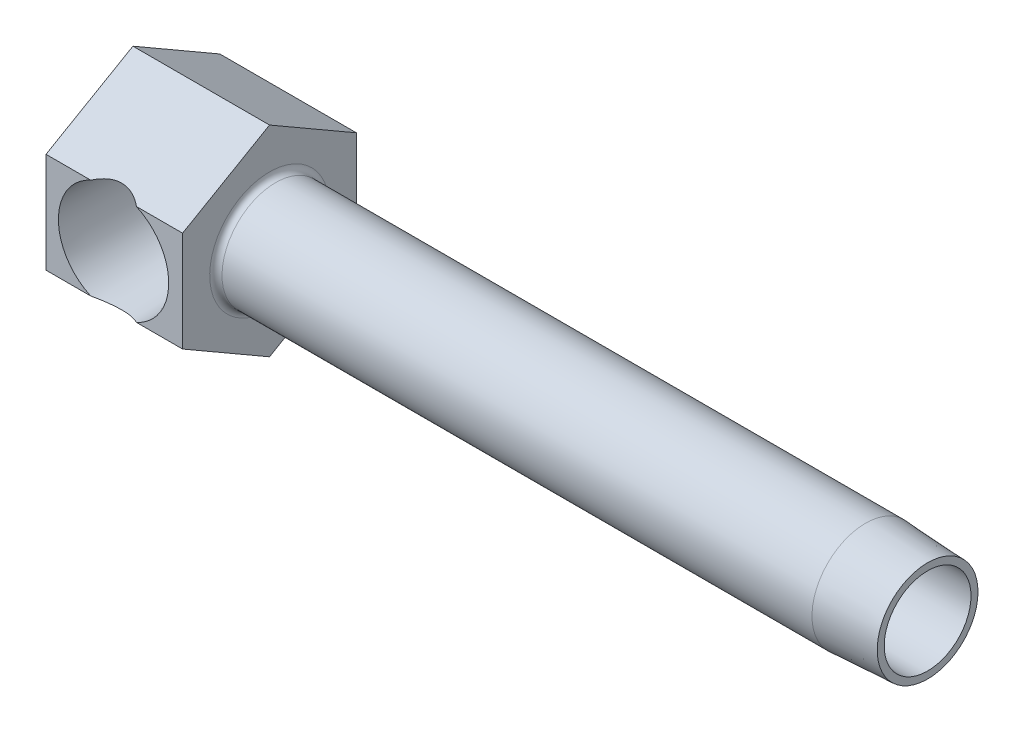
ISO-10303-21;
HEADER;
FILE_DESCRIPTION(('STEP AP214'),'2;1');
FILE_NAME('part.step','',(''),(''),'','','');
FILE_SCHEMA(('AUTOMOTIVE_DESIGN { 1 0 10303 214 1 1 1 1 }'));
ENDSEC;
DATA;
#1=APPLICATION_CONTEXT('core data for automotive mechanical design processes');
#2=APPLICATION_PROTOCOL_DEFINITION('international standard','automotive_design',2000,#1);
#3=PRODUCT_CONTEXT('',#1,'mechanical');
#4=PRODUCT('Part','Part','',(#3));
#5=PRODUCT_RELATED_PRODUCT_CATEGORY('part','',(#4));
#6=PRODUCT_DEFINITION_FORMATION('','',#4);
#7=PRODUCT_DEFINITION_CONTEXT('part definition',#1,'design');
#8=PRODUCT_DEFINITION('design','',#6,#7);
#9=PRODUCT_DEFINITION_SHAPE('','',#8);
#10=(LENGTH_UNIT() NAMED_UNIT(*) SI_UNIT(.MILLI.,.METRE.));
#11=(NAMED_UNIT(*) PLANE_ANGLE_UNIT() SI_UNIT($,.RADIAN.));
#12=(NAMED_UNIT(*) SI_UNIT($,.STERADIAN.) SOLID_ANGLE_UNIT());
#13=UNCERTAINTY_MEASURE_WITH_UNIT(LENGTH_MEASURE(1.E-05),#10,'distance_accuracy_value','');
#14=(GEOMETRIC_REPRESENTATION_CONTEXT(3) GLOBAL_UNCERTAINTY_ASSIGNED_CONTEXT((#13)) GLOBAL_UNIT_ASSIGNED_CONTEXT((#10,
#11,#12)) REPRESENTATION_CONTEXT('',''));
#15=CARTESIAN_POINT('',(0.,0.,0.));
#16=DIRECTION('',(0.,0.,1.));
#17=DIRECTION('',(1.,0.,0.));
#18=AXIS2_PLACEMENT_3D('',#15,#16,#17);
#19=CARTESIAN_POINT('',(63.5,0.,11.1125));
#20=DIRECTION('',(-1.,0.,0.));
#21=DIRECTION('',(0.,0.,1.));
#22=AXIS2_PLACEMENT_3D('',#19,#20,#21);
#23=CYLINDRICAL_SURFACE('',#22,6.858);
#24=CARTESIAN_POINT('',(18.2499,0.,11.1125));
#25=DIRECTION('',(-1.,0.,0.));
#26=DIRECTION('',(0.,-1.,0.));
#27=AXIS2_PLACEMENT_3D('',#24,#25,#26);
#28=CIRCLE('',#27,6.858);
#29=CARTESIAN_POINT('',(18.2499,-6.858,11.1125));
#30=VERTEX_POINT('',#29);
#31=EDGE_CURVE('E174',#30,#30,#28,.F.);
#32=ORIENTED_EDGE('',*,*,#31,.T.);
#33=EDGE_LOOP('',(#32));
#34=FACE_BOUND('',#33,.T.);
#35=CARTESIAN_POINT('',(93.6752,0.,11.1125));
#36=DIRECTION('',(1.,0.,0.));
#37=DIRECTION('',(0.,0.,-1.));
#38=AXIS2_PLACEMENT_3D('',#35,#36,#37);
#39=CIRCLE('',#38,6.858);
#40=CARTESIAN_POINT('',(93.6752,0.,4.2545));
#41=VERTEX_POINT('',#40);
#42=EDGE_CURVE('E218',#41,#41,#39,.T.);
#43=ORIENTED_EDGE('',*,*,#42,.F.);
#44=EDGE_LOOP('',(#43));
#45=FACE_BOUND('',#44,.T.);
#46=ADVANCED_FACE('F15',(#34,#45),#23,.T.);
#47=CARTESIAN_POINT('',(17.4625,6.4158048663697,22.225));
#48=DIRECTION('',(0.,0.,-1.));
#49=DIRECTION('',(0.,1.,0.));
#50=AXIS2_PLACEMENT_3D('',#47,#48,#49);
#51=PLANE('',#50);
#52=CARTESIAN_POINT('',(8.636,0.,22.225));
#53=DIRECTION('',(0.,0.,1.));
#54=DIRECTION('',(1.,0.,0.));
#55=AXIS2_PLACEMENT_3D('',#52,#53,#54);
#56=CIRCLE('',#55,7.05231);
#57=CARTESIAN_POINT('',(5.70811266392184,6.4158048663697,22.225));
#58=VERTEX_POINT('',#57);
#59=CARTESIAN_POINT('',(5.70811266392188,-6.41580486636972,22.225));
#60=VERTEX_POINT('',#59);
#61=EDGE_CURVE('E229',#58,#60,#56,.T.);
#62=ORIENTED_EDGE('',*,*,#61,.F.);
#63=DIRECTION('',(-1.,0.,0.));
#64=VECTOR('',#63,1.);
#65=CARTESIAN_POINT('',(17.4625,6.4158048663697,22.225));
#66=LINE('',#65,#64);
#67=CARTESIAN_POINT('',(0.,6.4158048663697,22.225));
#68=VERTEX_POINT('',#67);
#69=EDGE_CURVE('E158',#58,#68,#66,.T.);
#70=ORIENTED_EDGE('',*,*,#69,.T.);
#71=DIRECTION('',(0.,-1.,0.));
#72=VECTOR('',#71,1.);
#73=CARTESIAN_POINT('',(0.,6.4158048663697,22.225));
#74=LINE('',#73,#72);
#75=CARTESIAN_POINT('',(0.,-6.41580486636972,22.225));
#76=VERTEX_POINT('',#75);
#77=EDGE_CURVE('E128',#68,#76,#74,.T.);
#78=ORIENTED_EDGE('',*,*,#77,.T.);
#79=DIRECTION('',(-1.,0.,0.));
#80=VECTOR('',#79,1.);
#81=CARTESIAN_POINT('',(17.4625,-6.41580486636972,22.225));
#82=LINE('',#81,#80);
#83=EDGE_CURVE('E154',#60,#76,#82,.T.);
#84=ORIENTED_EDGE('',*,*,#83,.F.);
#85=EDGE_LOOP('',(#62,#70,#78,#84));
#86=FACE_BOUND('',#85,.T.);
#87=ADVANCED_FACE('F205',(#86),#51,.F.);
#88=CARTESIAN_POINT('',(11.5638873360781,-6.41580486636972,22.225));
#89=VERTEX_POINT('',#88);
#90=CARTESIAN_POINT('',(11.5638873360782,6.4158048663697,22.225));
#91=VERTEX_POINT('',#90);
#92=EDGE_CURVE('E228',#89,#91,#56,.T.);
#93=ORIENTED_EDGE('',*,*,#92,.F.);
#94=CARTESIAN_POINT('',(17.4625,-6.41580486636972,22.225));
#95=VERTEX_POINT('',#94);
#96=EDGE_CURVE('E155',#95,#89,#82,.T.);
#97=ORIENTED_EDGE('',*,*,#96,.F.);
#98=DIRECTION('',(0.,-1.,0.));
#99=VECTOR('',#98,1.);
#100=CARTESIAN_POINT('',(17.4625,6.4158048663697,22.225));
#101=LINE('',#100,#99);
#102=CARTESIAN_POINT('',(17.4625,6.4158048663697,22.225));
#103=VERTEX_POINT('',#102);
#104=EDGE_CURVE('E145',#103,#95,#101,.T.);
#105=ORIENTED_EDGE('',*,*,#104,.F.);
#106=EDGE_CURVE('E159',#103,#91,#66,.T.);
#107=ORIENTED_EDGE('',*,*,#106,.T.);
#108=EDGE_LOOP('',(#93,#97,#105,#107));
#109=FACE_BOUND('',#108,.T.);
#110=ADVANCED_FACE('F211',(#109),#51,.F.);
#111=CARTESIAN_POINT('',(17.4625,12.8316097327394,11.1125));
#112=DIRECTION('',(0.,-0.866025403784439,-0.5));
#113=DIRECTION('',(0.,0.5,-0.866025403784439));
#114=AXIS2_PLACEMENT_3D('',#111,#112,#113);
#115=PLANE('',#114);
#116=ORIENTED_EDGE('',*,*,#69,.F.);
#117=CARTESIAN_POINT('',(8.636,-0.384020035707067,34.002642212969));
#118=DIRECTION('',(0.,-0.866025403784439,-0.5));
#119=DIRECTION('',(0.,-0.5,0.866025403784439));
#120=AXIS2_PLACEMENT_3D('',#117,#118,#119);
#121=ELLIPSE('',#120,14.8098967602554,7.39498405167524);
#122=EDGE_CURVE('E109',#58,#91,#121,.T.);
#123=ORIENTED_EDGE('',*,*,#122,.T.);
#124=ORIENTED_EDGE('',*,*,#106,.F.);
#125=DIRECTION('',(0.,-0.5,0.866025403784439));
#126=VECTOR('',#125,1.);
#127=CARTESIAN_POINT('',(17.4625,12.8316097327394,11.1125));
#128=LINE('',#127,#126);
#129=CARTESIAN_POINT('',(17.4625,12.8316097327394,11.1125));
#130=VERTEX_POINT('',#129);
#131=EDGE_CURVE('E143',#130,#103,#128,.T.);
#132=ORIENTED_EDGE('',*,*,#131,.F.);
#133=DIRECTION('',(-1.,0.,0.));
#134=VECTOR('',#133,1.);
#135=CARTESIAN_POINT('',(17.4625,12.8316097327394,11.1125));
#136=LINE('',#135,#134);
#137=CARTESIAN_POINT('',(0.,12.8316097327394,11.1125));
#138=VERTEX_POINT('',#137);
#139=EDGE_CURVE('E162',#130,#138,#136,.T.);
#140=ORIENTED_EDGE('',*,*,#139,.T.);
#141=DIRECTION('',(0.,-0.5,0.866025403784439));
#142=VECTOR('',#141,1.);
#143=CARTESIAN_POINT('',(0.,12.8316097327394,11.1125));
#144=LINE('',#143,#142);
#145=EDGE_CURVE('E124',#138,#68,#144,.T.);
#146=ORIENTED_EDGE('',*,*,#145,.T.);
#147=EDGE_LOOP('',(#116,#123,#124,#132,#140,#146));
#148=FACE_BOUND('',#147,.T.);
#149=ADVANCED_FACE('F257',(#148),#115,.F.);
#150=CARTESIAN_POINT('',(17.4625,-6.41580486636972,22.225));
#151=DIRECTION('',(0.,0.866025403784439,-0.5));
#152=DIRECTION('',(0.,0.5,0.866025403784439));
#153=AXIS2_PLACEMENT_3D('',#150,#151,#152);
#154=PLANE('',#153);
#155=ORIENTED_EDGE('',*,*,#96,.T.);
#156=CARTESIAN_POINT('',(8.636,0.384020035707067,34.0026422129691));
#157=DIRECTION('',(0.,0.866025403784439,-0.5));
#158=DIRECTION('',(0.,0.5,0.866025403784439));
#159=AXIS2_PLACEMENT_3D('',#156,#157,#158);
#160=ELLIPSE('',#159,14.8098967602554,7.39498405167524);
#161=EDGE_CURVE('E34',#89,#60,#160,.T.);
#162=ORIENTED_EDGE('',*,*,#161,.T.);
#163=ORIENTED_EDGE('',*,*,#83,.T.);
#164=DIRECTION('',(0.,-0.5,-0.866025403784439));
#165=VECTOR('',#164,1.);
#166=CARTESIAN_POINT('',(0.,-6.41580486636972,22.225));
#167=LINE('',#166,#165);
#168=CARTESIAN_POINT('',(0.,-12.8316097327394,11.1125));
#169=VERTEX_POINT('',#168);
#170=EDGE_CURVE('E132',#76,#169,#167,.T.);
#171=ORIENTED_EDGE('',*,*,#170,.T.);
#172=DIRECTION('',(-1.,0.,0.));
#173=VECTOR('',#172,1.);
#174=CARTESIAN_POINT('',(17.4625,-12.8316097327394,11.1125));
#175=LINE('',#174,#173);
#176=CARTESIAN_POINT('',(17.4625,-12.8316097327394,11.1125));
#177=VERTEX_POINT('',#176);
#178=EDGE_CURVE('E149',#177,#169,#175,.T.);
#179=ORIENTED_EDGE('',*,*,#178,.F.);
#180=DIRECTION('',(0.,-0.5,-0.866025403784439));
#181=VECTOR('',#180,1.);
#182=CARTESIAN_POINT('',(17.4625,-6.41580486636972,22.225));
#183=LINE('',#182,#181);
#184=EDGE_CURVE('E147',#95,#177,#183,.T.);
#185=ORIENTED_EDGE('',*,*,#184,.F.);
#186=EDGE_LOOP('',(#155,#162,#163,#171,#179,#185));
#187=FACE_BOUND('',#186,.T.);
#188=ADVANCED_FACE('F235',(#187),#154,.F.);
#189=CARTESIAN_POINT('',(17.4625,-12.8316097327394,11.1125));
#190=DIRECTION('',(0.,0.866025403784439,0.5));
#191=DIRECTION('',(0.,-0.5,0.866025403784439));
#192=AXIS2_PLACEMENT_3D('',#189,#190,#191);
#193=PLANE('',#192);
#194=DIRECTION('',(0.,0.5,-0.866025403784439));
#195=VECTOR('',#194,1.);
#196=CARTESIAN_POINT('',(0.,-12.8316097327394,11.1125));
#197=LINE('',#196,#195);
#198=CARTESIAN_POINT('',(0.,-6.41580486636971,0.));
#199=VERTEX_POINT('',#198);
#200=EDGE_CURVE('E117',#169,#199,#197,.T.);
#201=ORIENTED_EDGE('',*,*,#200,.T.);
#202=DIRECTION('',(-1.,0.,0.));
#203=VECTOR('',#202,1.);
#204=CARTESIAN_POINT('',(17.4625,-6.41580486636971,0.));
#205=LINE('',#204,#203);
#206=CARTESIAN_POINT('',(17.4625,-6.41580486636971,0.));
#207=VERTEX_POINT('',#206);
#208=EDGE_CURVE('E168',#207,#199,#205,.T.);
#209=ORIENTED_EDGE('',*,*,#208,.F.);
#210=DIRECTION('',(0.,0.5,-0.866025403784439));
#211=VECTOR('',#210,1.);
#212=CARTESIAN_POINT('',(17.4625,-12.8316097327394,11.1125));
#213=LINE('',#212,#211);
#214=EDGE_CURVE('E135',#177,#207,#213,.T.);
#215=ORIENTED_EDGE('',*,*,#214,.F.);
#216=ORIENTED_EDGE('',*,*,#178,.T.);
#217=EDGE_LOOP('',(#201,#209,#215,#216));
#218=FACE_BOUND('',#217,.T.);
#219=ADVANCED_FACE('F247',(#218),#193,.F.);
#220=CARTESIAN_POINT('',(17.4625,-6.41580486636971,0.));
#221=DIRECTION('',(0.,0.,1.));
#222=DIRECTION('',(1.,0.,0.));
#223=AXIS2_PLACEMENT_3D('',#220,#221,#222);
#224=PLANE('',#223);
#225=DIRECTION('',(0.,1.,0.));
#226=VECTOR('',#225,1.);
#227=CARTESIAN_POINT('',(0.,-6.41580486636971,0.));
#228=LINE('',#227,#226);
#229=CARTESIAN_POINT('',(0.,6.41580486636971,0.));
#230=VERTEX_POINT('',#229);
#231=EDGE_CURVE('E118',#199,#230,#228,.T.);
#232=ORIENTED_EDGE('',*,*,#231,.T.);
#233=DIRECTION('',(-1.,0.,0.));
#234=VECTOR('',#233,1.);
#235=CARTESIAN_POINT('',(17.4625,6.41580486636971,0.));
#236=LINE('',#235,#234);
#237=CARTESIAN_POINT('',(17.4625,6.41580486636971,0.));
#238=VERTEX_POINT('',#237);
#239=EDGE_CURVE('E165',#238,#230,#236,.T.);
#240=ORIENTED_EDGE('',*,*,#239,.F.);
#241=DIRECTION('',(0.,1.,0.));
#242=VECTOR('',#241,1.);
#243=CARTESIAN_POINT('',(17.4625,-6.41580486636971,0.));
#244=LINE('',#243,#242);
#245=EDGE_CURVE('E139',#207,#238,#244,.T.);
#246=ORIENTED_EDGE('',*,*,#245,.F.);
#247=ORIENTED_EDGE('',*,*,#208,.T.);
#248=EDGE_LOOP('',(#232,#240,#246,#247));
#249=FACE_BOUND('',#248,.T.);
#250=ADVANCED_FACE('F264',(#249),#224,.F.);
#251=CARTESIAN_POINT('',(17.4625,6.4158048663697,0.));
#252=DIRECTION('',(0.,-0.866025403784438,0.5));
#253=DIRECTION('',(0.,-0.5,-0.866025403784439));
#254=AXIS2_PLACEMENT_3D('',#251,#252,#253);
#255=PLANE('',#254);
#256=DIRECTION('',(0.,0.5,0.866025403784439));
#257=VECTOR('',#256,1.);
#258=CARTESIAN_POINT('',(0.,6.4158048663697,0.));
#259=LINE('',#258,#257);
#260=EDGE_CURVE('E121',#230,#138,#259,.T.);
#261=ORIENTED_EDGE('',*,*,#260,.T.);
#262=ORIENTED_EDGE('',*,*,#139,.F.);
#263=DIRECTION('',(0.,0.5,0.866025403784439));
#264=VECTOR('',#263,1.);
#265=CARTESIAN_POINT('',(17.4625,6.4158048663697,0.));
#266=LINE('',#265,#264);
#267=EDGE_CURVE('E141',#238,#130,#266,.T.);
#268=ORIENTED_EDGE('',*,*,#267,.F.);
#269=ORIENTED_EDGE('',*,*,#239,.T.);
#270=EDGE_LOOP('',(#261,#262,#268,#269));
#271=FACE_BOUND('',#270,.T.);
#272=ADVANCED_FACE('F261',(#271),#255,.F.);
#273=CARTESIAN_POINT('',(17.4625,-19.2474145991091,22.225));
#274=DIRECTION('',(-1.,0.,0.));
#275=DIRECTION('',(0.,-1.,0.));
#276=AXIS2_PLACEMENT_3D('',#273,#274,#275);
#277=PLANE('',#276);
#278=CARTESIAN_POINT('',(17.4625,0.,11.1125));
#279=DIRECTION('',(-1.,0.,0.));
#280=DIRECTION('',(0.,-1.,0.));
#281=AXIS2_PLACEMENT_3D('',#278,#279,#280);
#282=CIRCLE('',#281,7.6454);
#283=CARTESIAN_POINT('',(17.4625,-7.6454,11.1125));
#284=VERTEX_POINT('',#283);
#285=EDGE_CURVE('E171',#284,#284,#282,.T.);
#286=ORIENTED_EDGE('',*,*,#285,.T.);
#287=EDGE_LOOP('',(#286));
#288=FACE_BOUND('',#287,.T.);
#289=ORIENTED_EDGE('',*,*,#214,.T.);
#290=ORIENTED_EDGE('',*,*,#245,.T.);
#291=ORIENTED_EDGE('',*,*,#267,.T.);
#292=ORIENTED_EDGE('',*,*,#131,.T.);
#293=ORIENTED_EDGE('',*,*,#104,.T.);
#294=ORIENTED_EDGE('',*,*,#184,.T.);
#295=EDGE_LOOP('',(#289,#290,#291,#292,#293,#294));
#296=FACE_BOUND('',#295,.T.);
#297=ADVANCED_FACE('F250',(#288,#296),#277,.F.);
#298=CARTESIAN_POINT('',(0.,-19.2474145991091,22.225));
#299=DIRECTION('',(-1.,0.,0.));
#300=DIRECTION('',(0.,-1.,0.));
#301=AXIS2_PLACEMENT_3D('',#298,#299,#300);
#302=PLANE('',#301);
#303=ORIENTED_EDGE('',*,*,#200,.F.);
#304=ORIENTED_EDGE('',*,*,#170,.F.);
#305=ORIENTED_EDGE('',*,*,#77,.F.);
#306=ORIENTED_EDGE('',*,*,#145,.F.);
#307=ORIENTED_EDGE('',*,*,#260,.F.);
#308=ORIENTED_EDGE('',*,*,#231,.F.);
#309=EDGE_LOOP('',(#303,#304,#305,#306,#307,#308));
#310=FACE_BOUND('',#309,.T.);
#311=ADVANCED_FACE('F243',(#310),#302,.T.);
#312=CARTESIAN_POINT('',(18.2499,0.,11.1125));
#313=DIRECTION('',(-1.,0.,0.));
#314=DIRECTION('',(0.,-1.,0.));
#315=AXIS2_PLACEMENT_3D('',#312,#313,#314);
#316=TOROIDAL_SURFACE('',#315,7.6454,0.7874);
#317=ORIENTED_EDGE('',*,*,#31,.F.);
#318=EDGE_LOOP('',(#317));
#319=FACE_BOUND('',#318,.T.);
#320=ORIENTED_EDGE('',*,*,#285,.F.);
#321=EDGE_LOOP('',(#320));
#322=FACE_BOUND('',#321,.T.);
#323=ADVANCED_FACE('F282',(#319,#322),#316,.F.);
#324=CARTESIAN_POINT('',(63.5,0.,11.1125));
#325=DIRECTION('',(1.,0.,0.));
#326=DIRECTION('',(0.,0.,-1.));
#327=AXIS2_PLACEMENT_3D('',#324,#325,#326);
#328=CYLINDRICAL_SURFACE('',#327,5.5499);
#329=DIRECTION('',(1.,0.,0.));
#330=VECTOR('',#329,1.);
#331=CARTESIAN_POINT('',(63.5,1.29165930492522,5.715));
#332=LINE('',#331,#330);
#333=CARTESIAN_POINT('',(15.0655177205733,1.29165930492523,5.715));
#334=VERTEX_POINT('',#333);
#335=CARTESIAN_POINT('',(14.0465577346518,1.29165930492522,5.715));
#336=VERTEX_POINT('',#335);
#337=EDGE_CURVE('E27',#334,#336,#332,.F.);
#338=ORIENTED_EDGE('',*,*,#337,.T.);
#339=CARTESIAN_POINT('',(14.0465577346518,1.29165930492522,5.715));
#340=CARTESIAN_POINT('',(14.0725617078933,1.1828202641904,5.68893317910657));
#341=CARTESIAN_POINT('',(14.0954190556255,1.0724477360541,5.66602138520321));
#342=CARTESIAN_POINT('',(14.1345363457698,0.849345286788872,5.62681178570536));
#343=CARTESIAN_POINT('',(14.1507939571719,0.736614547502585,5.61051631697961));
#344=CARTESIAN_POINT('',(14.1760383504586,0.512691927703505,5.58521342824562));
#345=CARTESIAN_POINT('',(14.1852120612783,0.401542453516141,5.57601863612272));
#346=CARTESIAN_POINT('',(14.1968530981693,0.17856718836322,5.56435088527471));
#347=CARTESIAN_POINT('',(14.1993222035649,0.0667415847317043,5.56187614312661));
#348=CARTESIAN_POINT('',(14.1975723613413,-0.14949882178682,5.56362999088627));
#349=CARTESIAN_POINT('',(14.193779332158,-0.253921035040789,5.56743168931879));
#350=CARTESIAN_POINT('',(14.1803598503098,-0.462026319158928,5.58088200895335));
#351=CARTESIAN_POINT('',(14.1707325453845,-0.565709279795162,5.59053148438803));
#352=CARTESIAN_POINT('',(14.1454600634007,-0.774399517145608,5.61586264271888));
#353=CARTESIAN_POINT('',(14.12966315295,-0.87936981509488,5.63169642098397));
#354=CARTESIAN_POINT('',(14.092340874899,-1.08722287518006,5.6691068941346));
#355=CARTESIAN_POINT('',(14.0708169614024,-1.1901061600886,5.69068213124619));
#356=CARTESIAN_POINT('',(14.0465577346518,-1.29165930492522,5.715));
#357=B_SPLINE_CURVE_WITH_KNOTS('',3,(#339,#340,#341,#342,#343,#344,#345,#346,#347,#348,#349,
#350,#351,#352,#353,#354,#355,#356),.UNSPECIFIED.,.F.,.F.,(4,2,2,2,2,2,2,2,4),(0.,
0.344637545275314,0.689396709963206,1.02471413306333,1.35994255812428,1.67329546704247,
1.98669416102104,2.30834220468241,2.62990865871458),.UNSPECIFIED.);
#358=CARTESIAN_POINT('',(14.0465577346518,-1.29165930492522,5.715));
#359=VERTEX_POINT('',#358);
#360=EDGE_CURVE('E10',#336,#359,#357,.T.);
#361=ORIENTED_EDGE('',*,*,#360,.T.);
#362=DIRECTION('',(1.,0.,0.));
#363=VECTOR('',#362,1.);
#364=CARTESIAN_POINT('',(63.5,-1.29165930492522,5.715));
#365=LINE('',#364,#363);
#366=CARTESIAN_POINT('',(15.0655177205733,-1.29165930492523,5.715));
#367=VERTEX_POINT('',#366);
#368=EDGE_CURVE('E184',#359,#367,#365,.T.);
#369=ORIENTED_EDGE('',*,*,#368,.T.);
#370=CARTESIAN_POINT('',(15.0656795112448,-1.29082327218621,5.71480000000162));
#371=CARTESIAN_POINT('',(15.0372536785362,-1.43791824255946,5.7499521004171));
#372=CARTESIAN_POINT('',(15.0041876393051,-1.58262926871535,5.79093746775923));
#373=CARTESIAN_POINT('',(14.9298152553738,-1.86616189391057,5.88364074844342));
#374=CARTESIAN_POINT('',(14.8885204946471,-2.00499144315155,5.93534357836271));
#375=CARTESIAN_POINT('',(14.7990709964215,-2.27477346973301,6.0481148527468));
#376=CARTESIAN_POINT('',(14.7509848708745,-2.40578805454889,6.10909004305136));
#377=CARTESIAN_POINT('',(14.6486806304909,-2.66083130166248,6.2399326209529));
#378=CARTESIAN_POINT('',(14.5944604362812,-2.78485757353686,6.30980302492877));
#379=CARTESIAN_POINT('',(14.4812536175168,-3.02482355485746,6.4572285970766));
#380=CARTESIAN_POINT('',(14.4222960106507,-3.1408054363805,6.53473755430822));
#381=CARTESIAN_POINT('',(14.3003856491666,-3.365215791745,6.6970845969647));
#382=CARTESIAN_POINT('',(14.2374332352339,-3.47364490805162,6.78192205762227));
#383=CARTESIAN_POINT('',(14.0435453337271,-3.78827180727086,7.04729631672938));
#384=CARTESIAN_POINT('',(13.9079456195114,-3.9830565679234,7.23822682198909));
#385=CARTESIAN_POINT('',(13.689310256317,-4.26816238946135,7.56146618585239));
#386=CARTESIAN_POINT('',(13.6074310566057,-4.3686517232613,7.68585924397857));
#387=CARTESIAN_POINT('',(13.4442899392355,-4.55879004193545,7.94320688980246));
#388=CARTESIAN_POINT('',(13.3630282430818,-4.6484352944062,8.07616440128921));
#389=CARTESIAN_POINT('',(13.2036424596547,-4.81645966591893,8.35044586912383));
#390=CARTESIAN_POINT('',(13.1255135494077,-4.89485662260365,8.49175606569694));
#391=CARTESIAN_POINT('',(12.9752684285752,-5.04004510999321,8.78316437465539));
#392=CARTESIAN_POINT('',(12.9031480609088,-5.10684469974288,8.93325628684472));
#393=CARTESIAN_POINT('',(12.757824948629,-5.23785122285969,9.26762207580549));
#394=CARTESIAN_POINT('',(12.686320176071,-5.29990617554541,9.45350692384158));
#395=CARTESIAN_POINT('',(12.5645322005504,-5.40502712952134,9.83721903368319));
#396=CARTESIAN_POINT('',(12.5142004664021,-5.44813656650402,10.035017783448));
#397=CARTESIAN_POINT('',(12.4606756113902,-5.49679755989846,10.3395644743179));
#398=CARTESIAN_POINT('',(12.4464754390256,-5.51038902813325,10.443158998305));
#399=CARTESIAN_POINT('',(12.4264834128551,-5.5317354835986,10.6517762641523));
#400=CARTESIAN_POINT('',(12.4206908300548,-5.53949097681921,10.7567988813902));
#401=CARTESIAN_POINT('',(12.4179376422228,-5.54899639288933,10.9671942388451));
#402=CARTESIAN_POINT('',(12.4209736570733,-5.55074861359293,11.0725668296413));
#403=CARTESIAN_POINT('',(12.4357182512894,-5.54828805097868,11.2826067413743));
#404=CARTESIAN_POINT('',(12.4474268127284,-5.54407527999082,11.3872740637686));
#405=CARTESIAN_POINT('',(12.4900727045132,-5.52483789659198,11.6684350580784));
#406=CARTESIAN_POINT('',(12.5287513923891,-5.5042766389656,11.8434168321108));
#407=CARTESIAN_POINT('',(12.6245766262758,-5.44793106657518,12.1856637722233));
#408=CARTESIAN_POINT('',(12.6817493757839,-5.41212512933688,12.3529176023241));
#409=CARTESIAN_POINT('',(12.8020710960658,-5.33165221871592,12.6608364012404));
#410=CARTESIAN_POINT('',(12.8638814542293,-5.28838367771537,12.8024081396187));
#411=CARTESIAN_POINT('',(12.9946271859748,-5.19196308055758,13.0788046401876));
#412=CARTESIAN_POINT('',(13.0635675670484,-5.13880405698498,13.2136245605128));
#413=CARTESIAN_POINT('',(13.2061680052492,-5.0230773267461,13.476991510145));
#414=CARTESIAN_POINT('',(13.2798387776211,-4.96048779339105,13.6055230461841));
#415=CARTESIAN_POINT('',(13.4297455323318,-4.82635797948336,13.8561944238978));
#416=CARTESIAN_POINT('',(13.505980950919,-4.75481965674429,13.9783356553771));
#417=CARTESIAN_POINT('',(13.664111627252,-4.59832635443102,14.2236446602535));
#418=CARTESIAN_POINT('',(13.7460684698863,-4.51281916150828,14.3464205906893));
#419=CARTESIAN_POINT('',(13.9094765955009,-4.33199713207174,14.5849036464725));
#420=CARTESIAN_POINT('',(13.9909278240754,-4.23668125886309,14.7006100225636));
#421=CARTESIAN_POINT('',(14.1517819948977,-4.03638256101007,14.9245234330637));
#422=CARTESIAN_POINT('',(14.231187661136,-3.93141354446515,15.0327408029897));
#423=CARTESIAN_POINT('',(14.3867175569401,-3.71172769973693,15.2413555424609));
#424=CARTESIAN_POINT('',(14.4628409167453,-3.59700831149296,15.3417508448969));
#425=CARTESIAN_POINT('',(14.668135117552,-3.26437402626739,15.6091426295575));
#426=CARTESIAN_POINT('',(14.7924014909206,-3.03572507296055,15.7670513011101));
#427=CARTESIAN_POINT('',(14.961823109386,-2.67104021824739,15.9794040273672));
#428=CARTESIAN_POINT('',(15.0154673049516,-2.54586009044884,16.0461031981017));
#429=CARTESIAN_POINT('',(15.1161712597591,-2.28856209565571,16.1705894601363));
#430=CARTESIAN_POINT('',(15.1632322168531,-2.15644549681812,16.2283781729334));
#431=CARTESIAN_POINT('',(15.2428146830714,-1.9076542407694,16.3256678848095));
#432=CARTESIAN_POINT('',(15.2764575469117,-1.79190088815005,16.3666154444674));
#433=CARTESIAN_POINT('',(15.3378292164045,-1.55651069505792,16.4410921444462));
#434=CARTESIAN_POINT('',(15.3655591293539,-1.43687458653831,16.4746226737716));
#435=CARTESIAN_POINT('',(15.4145953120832,-1.19439983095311,16.5337884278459));
#436=CARTESIAN_POINT('',(15.4359031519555,-1.0715619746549,16.5594255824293));
#437=CARTESIAN_POINT('',(15.4716760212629,-0.823504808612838,16.6024058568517));
#438=CARTESIAN_POINT('',(15.4861437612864,-0.698286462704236,16.6197522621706));
#439=CARTESIAN_POINT('',(15.5079865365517,-0.445852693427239,16.645922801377));
#440=CARTESIAN_POINT('',(15.5153340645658,-0.318631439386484,16.6547138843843));
#441=CARTESIAN_POINT('',(15.522677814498,-0.063671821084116,16.6635004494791));
#442=CARTESIAN_POINT('',(15.5226740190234,0.0640665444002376,16.6634959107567));
#443=CARTESIAN_POINT('',(15.5153149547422,0.319031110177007,16.6546910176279));
#444=CARTESIAN_POINT('',(15.5079593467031,0.446257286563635,16.64589025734));
#445=CARTESIAN_POINT('',(15.4860583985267,0.699182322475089,16.6196499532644));
#446=CARTESIAN_POINT('',(15.4715132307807,0.824881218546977,16.6022106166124));
#447=CARTESIAN_POINT('',(15.4365532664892,1.06681669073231,16.5602063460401));
#448=CARTESIAN_POINT('',(15.4165150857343,1.18318753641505,16.5360979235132));
#449=CARTESIAN_POINT('',(15.370668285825,1.41308832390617,16.4807930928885));
#450=CARTESIAN_POINT('',(15.3448577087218,1.52661728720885,16.4495942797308));
#451=CARTESIAN_POINT('',(15.2593968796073,1.8619852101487,16.3459550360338));
#452=CARTESIAN_POINT('',(15.1916934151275,2.07876635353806,16.2634431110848));
#453=CARTESIAN_POINT('',(15.0313088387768,2.51543897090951,16.0659794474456));
#454=CARTESIAN_POINT('',(14.9368359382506,2.73357267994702,15.9486491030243));
#455=CARTESIAN_POINT('',(14.7321201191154,3.14711164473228,15.6903358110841));
#456=CARTESIAN_POINT('',(14.6218705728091,3.34250728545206,15.549342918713));
#457=CARTESIAN_POINT('',(14.3660176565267,3.74896640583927,15.2149275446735));
#458=CARTESIAN_POINT('',(14.217881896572,3.95452519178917,15.0167316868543));
#459=CARTESIAN_POINT('',(13.9905991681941,4.23685264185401,14.7000501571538));
#460=CARTESIAN_POINT('',(13.9138995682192,4.32671599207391,14.5911203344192));
#461=CARTESIAN_POINT('',(13.7600052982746,4.49774000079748,14.366972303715));
#462=CARTESIAN_POINT('',(13.682810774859,4.57890311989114,14.2517558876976));
#463=CARTESIAN_POINT('',(13.5283146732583,4.73340315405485,14.0136509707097));
#464=CARTESIAN_POINT('',(13.4510233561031,4.80663208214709,13.8906858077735));
#465=CARTESIAN_POINT('',(13.2989020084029,4.94395744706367,13.6382338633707));
#466=CARTESIAN_POINT('',(13.2240725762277,5.00805167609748,13.5087455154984));
#467=CARTESIAN_POINT('',(13.0790371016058,5.12664196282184,13.2432341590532));
#468=CARTESIAN_POINT('',(13.0088235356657,5.18115389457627,13.107222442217));
#469=CARTESIAN_POINT('',(12.8755190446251,5.28008101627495,12.8283198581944));
#470=CARTESIAN_POINT('',(12.8124234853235,5.3245027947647,12.6854335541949));
#471=CARTESIAN_POINT('',(12.6833891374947,5.4112685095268,12.3591277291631));
#472=CARTESIAN_POINT('',(12.6200540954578,5.45085356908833,12.1738679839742));
#473=CARTESIAN_POINT('',(12.5423523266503,5.49611259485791,11.8892630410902));
#474=CARTESIAN_POINT('',(12.5193453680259,5.50884182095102,11.7933456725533));
#475=CARTESIAN_POINT('',(12.4799604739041,5.52933440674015,11.5996550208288));
#476=CARTESIAN_POINT('',(12.4635791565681,5.53710030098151,11.5018827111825));
#477=CARTESIAN_POINT('',(12.4380468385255,5.54748556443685,11.3040796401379));
#478=CARTESIAN_POINT('',(12.4289726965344,5.55005064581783,11.2040359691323));
#479=CARTESIAN_POINT('',(12.418786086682,5.54973569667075,11.0035516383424));
#480=CARTESIAN_POINT('',(12.4176731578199,5.54685598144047,10.9031110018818));
#481=CARTESIAN_POINT('',(12.4234254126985,5.53566138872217,10.7027211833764));
#482=CARTESIAN_POINT('',(12.4302942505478,5.52734402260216,10.6027722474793));
#483=CARTESIAN_POINT('',(12.4515981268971,5.5054275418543,10.4042328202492));
#484=CARTESIAN_POINT('',(12.4660373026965,5.4918255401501,10.3056431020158));
#485=CARTESIAN_POINT('',(12.5044721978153,5.45712893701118,10.0955734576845));
#486=CARTESIAN_POINT('',(12.5295946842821,5.43520467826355,9.98443807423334));
#487=CARTESIAN_POINT('',(12.5874763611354,5.38514310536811,9.76556012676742));
#488=CARTESIAN_POINT('',(12.6202414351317,5.35700100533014,9.65782024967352));
#489=CARTESIAN_POINT('',(12.6919869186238,5.29489520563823,9.44585515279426));
#490=CARTESIAN_POINT('',(12.7309829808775,5.2609168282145,9.34163960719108));
#491=CARTESIAN_POINT('',(12.813732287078,5.18758941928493,9.13712531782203));
#492=CARTESIAN_POINT('',(12.8574843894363,5.14824167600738,9.03682564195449));
#493=CARTESIAN_POINT('',(12.9739768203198,5.04107082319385,8.78510193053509));
#494=CARTESIAN_POINT('',(13.0492646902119,4.96961386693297,8.63639571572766));
#495=CARTESIAN_POINT('',(13.2048344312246,4.81508369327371,8.34787401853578));
#496=CARTESIAN_POINT('',(13.2851189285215,4.73200433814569,8.20806329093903));
#497=CARTESIAN_POINT('',(13.4480056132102,4.55446924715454,7.93688996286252));
#498=CARTESIAN_POINT('',(13.5306114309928,4.45999483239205,7.80554179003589));
#499=CARTESIAN_POINT('',(13.6957298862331,4.25996324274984,7.55156980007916));
#500=CARTESIAN_POINT('',(13.7782425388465,4.15440825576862,7.42894426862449));
#501=CARTESIAN_POINT('',(13.9441031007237,3.92836612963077,7.18853642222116));
#502=CARTESIAN_POINT('',(14.0273794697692,3.80748613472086,7.0710730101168));
#503=CARTESIAN_POINT('',(14.1898135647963,3.55392137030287,6.84638586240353));
#504=CARTESIAN_POINT('',(14.2689704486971,3.42123420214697,6.73916421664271));
#505=CARTESIAN_POINT('',(14.420885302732,3.14485348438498,6.53641941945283));
#506=CARTESIAN_POINT('',(14.4936705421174,3.0012123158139,6.44084565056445));
#507=CARTESIAN_POINT('',(14.6312840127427,2.70291662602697,6.2621549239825));
#508=CARTESIAN_POINT('',(14.6961173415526,2.54826926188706,6.17902997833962));
#509=CARTESIAN_POINT('',(14.8204425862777,2.21665612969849,6.02094073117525));
#510=CARTESIAN_POINT('',(14.8791782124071,2.03888590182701,5.94704372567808));
#511=CARTESIAN_POINT('',(14.957111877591,1.76426185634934,5.84958505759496));
#512=CARTESIAN_POINT('',(14.9814347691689,1.67119024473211,5.81928093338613));
#513=CARTESIAN_POINT('',(15.0263924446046,1.48269404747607,5.76341790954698));
#514=CARTESIAN_POINT('',(15.047024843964,1.38726798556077,5.73786207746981));
#515=CARTESIAN_POINT('',(15.0656795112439,1.2908232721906,5.71480000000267));
#516=B_SPLINE_CURVE_WITH_KNOTS('',3,(#370,#371,#372,#373,#374,#375,#376,#377,#378,#379,#380,
#381,#382,#383,#384,#385,#386,#387,#388,#389,#390,#391,#392,#393,#394,#395,#396,#397,#398,#399,
#400,#401,#402,#403,#404,#405,#406,#407,#408,#409,#410,#411,#412,#413,#414,#415,#416,#417,#418,
#419,#420,#421,#422,#423,#424,#425,#426,#427,#428,#429,#430,#431,#432,#433,#434,#435,#436,#437,
#438,#439,#440,#441,#442,#443,#444,#445,#446,#447,#448,#449,#450,#451,#452,#453,#454,#455,#456,
#457,#458,#459,#460,#461,#462,#463,#464,#465,#466,#467,#468,#469,#470,#471,#472,#473,#474,#475,
#476,#477,#478,#479,#480,#481,#482,#483,#484,#485,#486,#487,#488,#489,#490,#491,#492,#493,#494,
#495,#496,#497,#498,#499,#500,#501,#502,#503,#504,#505,#506,#507,#508,#509,#510,#511,#512,#513,
#514,#515),.UNSPECIFIED.,.F.,.F.,(4,2,2,2,2,2,2,2,2,2,2,2,2,2,2,2,2,2,2,2,2,2,2,2,2,2,2,2,2,2,2,
2,2,2,2,2,2,2,2,2,2,2,2,2,2,2,2,2,2,2,2,2,2,2,2,2,2,2,2,2,2,2,2,2,2,2,2,2,2,2,2,2,4),(0.,
0.461329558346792,0.922014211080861,1.37833951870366,1.83481998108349,2.2886910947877,
2.74252355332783,3.65304009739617,4.19159436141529,4.73033346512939,5.26820855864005,
5.80570837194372,6.42981366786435,7.05248053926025,7.36837231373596,7.68423669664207,
7.99998016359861,8.31572297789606,8.85459341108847,9.39423071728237,9.87481564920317,
10.3557404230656,10.837795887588,11.3197460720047,11.8310943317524,12.3424966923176,
12.8531785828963,13.3639949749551,14.2729996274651,14.7275015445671,15.1819206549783,
15.5634665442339,15.9449409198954,16.3263219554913,16.707551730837,17.0902484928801,
17.472946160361,17.8556614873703,18.2383676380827,18.5995247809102,18.9608046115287,
19.682873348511,20.4753483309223,21.2681572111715,22.2295647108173,22.7113905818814,
23.1930798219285,23.6806666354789,24.1683710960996,24.6552598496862,25.1418297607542,
25.7388115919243,26.0368814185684,26.3347989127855,26.6358104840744,26.9368046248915,
27.237936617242,27.5392333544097,27.8867825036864,28.2346001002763,28.5833055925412,
28.9319275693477,29.4751694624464,30.0186993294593,30.5631325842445,31.1074585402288,
31.6708023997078,32.2342609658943,32.7951763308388,33.3557302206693,33.9579898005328,
34.2603814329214,34.5629677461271),.UNSPECIFIED.);
#517=EDGE_CURVE('E177',#367,#334,#516,.T.);
#518=ORIENTED_EDGE('',*,*,#517,.T.);
#519=EDGE_LOOP('',(#338,#361,#369,#518));
#520=FACE_BOUND('',#519,.T.);
#521=CARTESIAN_POINT('',(101.6,0.,11.1125));
#522=DIRECTION('',(1.,0.,0.));
#523=DIRECTION('',(0.,0.,-1.));
#524=AXIS2_PLACEMENT_3D('',#521,#522,#523);
#525=CIRCLE('',#524,5.5499);
#526=CARTESIAN_POINT('',(101.6,0.,5.5626));
#527=VERTEX_POINT('',#526);
#528=EDGE_CURVE('E223',#527,#527,#525,.T.);
#529=ORIENTED_EDGE('',*,*,#528,.T.);
#530=EDGE_LOOP('',(#529));
#531=FACE_BOUND('',#530,.T.);
#532=ADVANCED_FACE('F185',(#520,#531),#328,.F.);
#533=CARTESIAN_POINT('',(14.1986,0.,5.715));
#534=DIRECTION('',(0.,0.,-1.));
#535=DIRECTION('',(-1.,0.,0.));
#536=AXIS2_PLACEMENT_3D('',#533,#534,#535);
#537=PLANE('',#536);
#538=CARTESIAN_POINT('',(8.636,0.,5.715));
#539=DIRECTION('',(0.,0.,1.));
#540=DIRECTION('',(1.,0.,0.));
#541=AXIS2_PLACEMENT_3D('',#538,#539,#540);
#542=CIRCLE('',#541,6.55797849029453);
#543=EDGE_CURVE('E41',#334,#367,#542,.T.);
#544=ORIENTED_EDGE('',*,*,#543,.T.);
#545=ORIENTED_EDGE('',*,*,#368,.F.);
#546=CARTESIAN_POINT('',(8.636,0.,5.715));
#547=DIRECTION('',(0.,0.,1.));
#548=DIRECTION('',(1.,0.,0.));
#549=AXIS2_PLACEMENT_3D('',#546,#547,#548);
#550=CIRCLE('',#549,5.5626);
#551=EDGE_CURVE('E107',#336,#359,#550,.T.);
#552=ORIENTED_EDGE('',*,*,#551,.F.);
#553=ORIENTED_EDGE('',*,*,#337,.F.);
#554=EDGE_LOOP('',(#544,#545,#552,#553));
#555=FACE_BOUND('',#554,.T.);
#556=ADVANCED_FACE('F194',(#555),#537,.F.);
#557=CARTESIAN_POINT('',(8.636,0.,22.225));
#558=DIRECTION('',(0.,0.,1.));
#559=DIRECTION('',(1.,0.,0.));
#560=AXIS2_PLACEMENT_3D('',#557,#558,#559);
#561=CYLINDRICAL_SURFACE('',#560,5.5626);
#562=CARTESIAN_POINT('',(8.636,0.,4.445));
#563=DIRECTION('',(0.,0.,1.));
#564=DIRECTION('',(1.,0.,0.));
#565=AXIS2_PLACEMENT_3D('',#562,#563,#564);
#566=CIRCLE('',#565,5.5626);
#567=CARTESIAN_POINT('',(14.1986,0.,4.445));
#568=VERTEX_POINT('',#567);
#569=EDGE_CURVE('E105',#568,#568,#566,.T.);
#570=ORIENTED_EDGE('',*,*,#569,.F.);
#571=EDGE_LOOP('',(#570));
#572=FACE_BOUND('',#571,.T.);
#573=ORIENTED_EDGE('',*,*,#551,.T.);
#574=ORIENTED_EDGE('',*,*,#360,.F.);
#575=EDGE_LOOP('',(#573,#574));
#576=FACE_BOUND('',#575,.T.);
#577=ADVANCED_FACE('F192',(#572,#576),#561,.F.);
#578=CARTESIAN_POINT('',(8.636,0.,22.225));
#579=DIRECTION('',(0.,0.,1.));
#580=DIRECTION('',(1.,0.,0.));
#581=AXIS2_PLACEMENT_3D('',#578,#579,#580);
#582=CONICAL_SURFACE('',#581,7.05231,0.0299323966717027);
#583=ORIENTED_EDGE('',*,*,#543,.F.);
#584=ORIENTED_EDGE('',*,*,#517,.F.);
#585=EDGE_LOOP('',(#583,#584));
#586=FACE_BOUND('',#585,.T.);
#587=ORIENTED_EDGE('',*,*,#61,.T.);
#588=ORIENTED_EDGE('',*,*,#161,.F.);
#589=ORIENTED_EDGE('',*,*,#92,.T.);
#590=ORIENTED_EDGE('',*,*,#122,.F.);
#591=EDGE_LOOP('',(#587,#588,#589,#590));
#592=FACE_BOUND('',#591,.T.);
#593=ADVANCED_FACE('F101',(#586,#592),#582,.F.);
#594=CARTESIAN_POINT('',(8.636,0.,4.445));
#595=DIRECTION('',(0.,0.,1.));
#596=DIRECTION('',(1.,0.,0.));
#597=AXIS2_PLACEMENT_3D('',#594,#595,#596);
#598=CONICAL_SURFACE('',#597,5.5626,1.02974425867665);
#599=CARTESIAN_POINT('',(8.636,0.,1.10265272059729));
#600=VERTEX_POINT('',#599);
#601=VERTEX_LOOP('',#600);
#602=FACE_BOUND('',#601,.T.);
#603=ORIENTED_EDGE('',*,*,#569,.T.);
#604=EDGE_LOOP('',(#603));
#605=FACE_BOUND('',#604,.T.);
#606=ADVANCED_FACE('F97',(#602,#605),#598,.F.);
#607=CARTESIAN_POINT('',(101.6,0.,5.5626));
#608=DIRECTION('',(1.,0.,0.));
#609=DIRECTION('',(0.,0.,-1.));
#610=AXIS2_PLACEMENT_3D('',#607,#608,#609);
#611=PLANE('',#610);
#612=CARTESIAN_POINT('',(101.6,0.,11.1125));
#613=DIRECTION('',(1.,0.,0.));
#614=DIRECTION('',(0.,0.,-1.));
#615=AXIS2_PLACEMENT_3D('',#612,#613,#614);
#616=CIRCLE('',#615,6.44267883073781);
#617=CARTESIAN_POINT('',(101.6,0.,4.66982116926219));
#618=VERTEX_POINT('',#617);
#619=EDGE_CURVE('E220',#618,#618,#616,.T.);
#620=ORIENTED_EDGE('',*,*,#619,.T.);
#621=EDGE_LOOP('',(#620));
#622=FACE_BOUND('',#621,.T.);
#623=ORIENTED_EDGE('',*,*,#528,.F.);
#624=EDGE_LOOP('',(#623));
#625=FACE_BOUND('',#624,.T.);
#626=ADVANCED_FACE('F100',(#622,#625),#611,.T.);
#627=CARTESIAN_POINT('',(101.6,0.,11.1125));
#628=DIRECTION('',(-1.,0.,0.));
#629=DIRECTION('',(0.,0.,1.));
#630=AXIS2_PLACEMENT_3D('',#627,#628,#629);
#631=CONICAL_SURFACE('',#630,6.44267883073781,0.052359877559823);
#632=ORIENTED_EDGE('',*,*,#42,.T.);
#633=EDGE_LOOP('',(#632));
#634=FACE_BOUND('',#633,.T.);
#635=ORIENTED_EDGE('',*,*,#619,.F.);
#636=EDGE_LOOP('',(#635));
#637=FACE_BOUND('',#636,.T.);
#638=ADVANCED_FACE('F300',(#634,#637),#631,.T.);
#639=CLOSED_SHELL('',(#46,#87,#110,#149,#188,#219,#250,#272,#297,#311,#323,#532,#556,#577,#593,
#606,#626,#638));
#640=MANIFOLD_SOLID_BREP('B1',#639);
#641=ADVANCED_BREP_SHAPE_REPRESENTATION('',(#18,#640),#14);
#642=SHAPE_DEFINITION_REPRESENTATION(#9,#641);
ENDSEC;
END-ISO-10303-21;
